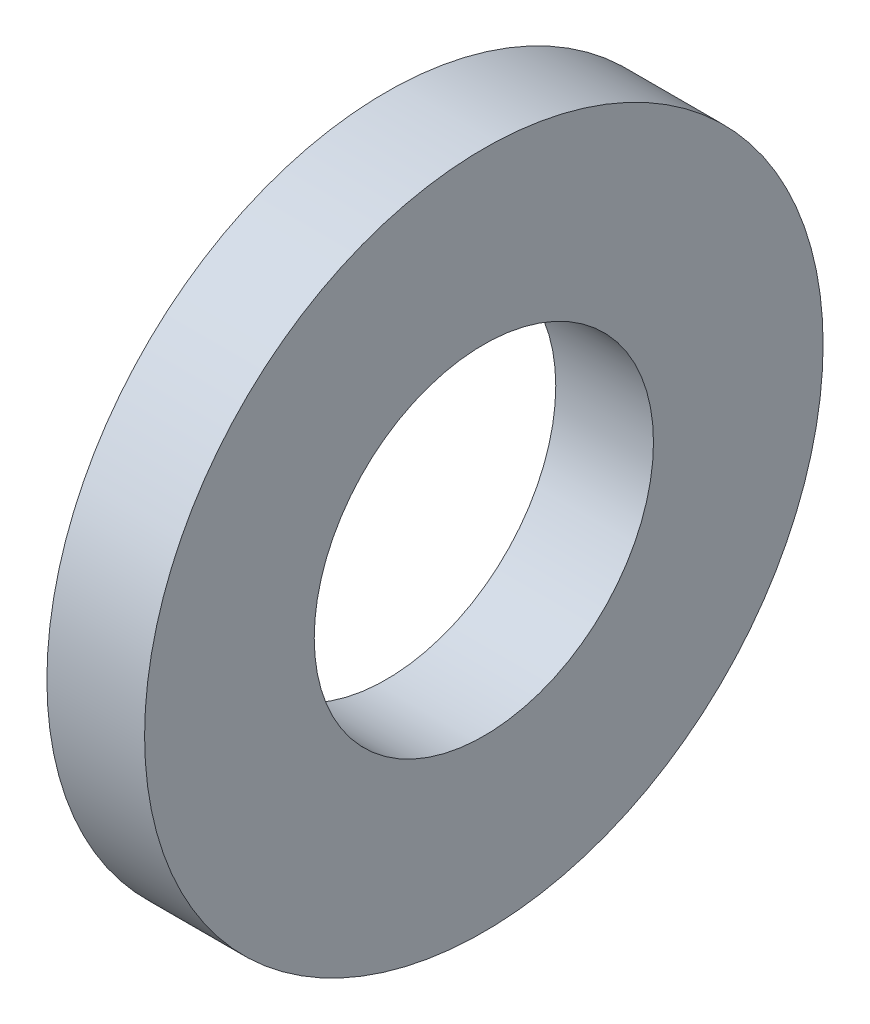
ISO-10303-21;
HEADER;
FILE_DESCRIPTION(('STEP AP214'),'2;1');
FILE_NAME('part.step','',(''),(''),'','','');
FILE_SCHEMA(('AUTOMOTIVE_DESIGN { 1 0 10303 214 1 1 1 1 }'));
ENDSEC;
DATA;
#1=APPLICATION_CONTEXT('core data for automotive mechanical design processes');
#2=APPLICATION_PROTOCOL_DEFINITION('international standard','automotive_design',2000,#1);
#3=PRODUCT_CONTEXT('',#1,'mechanical');
#4=PRODUCT('Part','Part','',(#3));
#5=PRODUCT_RELATED_PRODUCT_CATEGORY('part','',(#4));
#6=PRODUCT_DEFINITION_FORMATION('','',#4);
#7=PRODUCT_DEFINITION_CONTEXT('part definition',#1,'design');
#8=PRODUCT_DEFINITION('design','',#6,#7);
#9=PRODUCT_DEFINITION_SHAPE('','',#8);
#10=(LENGTH_UNIT() NAMED_UNIT(*) SI_UNIT(.MILLI.,.METRE.));
#11=(NAMED_UNIT(*) PLANE_ANGLE_UNIT() SI_UNIT($,.RADIAN.));
#12=(NAMED_UNIT(*) SI_UNIT($,.STERADIAN.) SOLID_ANGLE_UNIT());
#13=UNCERTAINTY_MEASURE_WITH_UNIT(LENGTH_MEASURE(1.E-05),#10,'distance_accuracy_value','');
#14=(GEOMETRIC_REPRESENTATION_CONTEXT(3) GLOBAL_UNCERTAINTY_ASSIGNED_CONTEXT((#13)) GLOBAL_UNIT_ASSIGNED_CONTEXT((#10,
#11,#12)) REPRESENTATION_CONTEXT('',''));
#15=CARTESIAN_POINT('',(0.,0.,0.));
#16=DIRECTION('',(0.,0.,1.));
#17=DIRECTION('',(1.,0.,0.));
#18=AXIS2_PLACEMENT_3D('',#15,#16,#17);
#19=CARTESIAN_POINT('',(0.9144,0.,0.));
#20=DIRECTION('',(1.,0.,0.));
#21=DIRECTION('',(0.,0.,-1.));
#22=AXIS2_PLACEMENT_3D('',#19,#20,#21);
#23=PLANE('',#22);
#24=CARTESIAN_POINT('',(0.9144,0.,0.));
#25=DIRECTION('',(1.,0.,0.));
#26=DIRECTION('',(0.,0.,-1.));
#27=AXIS2_PLACEMENT_3D('',#24,#25,#26);
#28=CIRCLE('',#27,3.175);
#29=CARTESIAN_POINT('',(0.9144,0.,-3.175));
#30=VERTEX_POINT('',#29);
#31=EDGE_CURVE('E10',#30,#30,#28,.T.);
#32=ORIENTED_EDGE('',*,*,#31,.T.);
#33=EDGE_LOOP('',(#32));
#34=FACE_BOUND('',#33,.T.);
#35=CARTESIAN_POINT('',(0.9144,0.,0.));
#36=DIRECTION('',(1.,0.,0.));
#37=DIRECTION('',(0.,0.,-1.));
#38=AXIS2_PLACEMENT_3D('',#35,#36,#37);
#39=CIRCLE('',#38,1.5875);
#40=CARTESIAN_POINT('',(0.9144,0.,-1.5875));
#41=VERTEX_POINT('',#40);
#42=EDGE_CURVE('E41',#41,#41,#39,.T.);
#43=ORIENTED_EDGE('',*,*,#42,.F.);
#44=EDGE_LOOP('',(#43));
#45=FACE_BOUND('',#44,.T.);
#46=ADVANCED_FACE('F30',(#34,#45),#23,.T.);
#47=CARTESIAN_POINT('',(0.,0.,0.));
#48=DIRECTION('',(1.,0.,0.));
#49=DIRECTION('',(0.,0.,-1.));
#50=AXIS2_PLACEMENT_3D('',#47,#48,#49);
#51=PLANE('',#50);
#52=CARTESIAN_POINT('',(0.,0.,0.));
#53=DIRECTION('',(1.,0.,0.));
#54=DIRECTION('',(0.,0.,-1.));
#55=AXIS2_PLACEMENT_3D('',#52,#53,#54);
#56=CIRCLE('',#55,3.175);
#57=CARTESIAN_POINT('',(0.,0.,-3.175));
#58=VERTEX_POINT('',#57);
#59=EDGE_CURVE('E34',#58,#58,#56,.T.);
#60=ORIENTED_EDGE('',*,*,#59,.F.);
#61=EDGE_LOOP('',(#60));
#62=FACE_BOUND('',#61,.T.);
#63=CARTESIAN_POINT('',(0.,0.,0.));
#64=DIRECTION('',(1.,0.,0.));
#65=DIRECTION('',(0.,0.,-1.));
#66=AXIS2_PLACEMENT_3D('',#63,#64,#65);
#67=CIRCLE('',#66,1.5875);
#68=CARTESIAN_POINT('',(0.,0.,-1.5875));
#69=VERTEX_POINT('',#68);
#70=EDGE_CURVE('E43',#69,#69,#67,.T.);
#71=ORIENTED_EDGE('',*,*,#70,.T.);
#72=EDGE_LOOP('',(#71));
#73=FACE_BOUND('',#72,.T.);
#74=ADVANCED_FACE('F53',(#62,#73),#51,.F.);
#75=CARTESIAN_POINT('',(0.9144,0.,0.));
#76=DIRECTION('',(-1.,0.,0.));
#77=DIRECTION('',(0.,0.,1.));
#78=AXIS2_PLACEMENT_3D('',#75,#76,#77);
#79=CYLINDRICAL_SURFACE('',#78,3.175);
#80=ORIENTED_EDGE('',*,*,#31,.F.);
#81=EDGE_LOOP('',(#80));
#82=FACE_BOUND('',#81,.T.);
#83=ORIENTED_EDGE('',*,*,#59,.T.);
#84=EDGE_LOOP('',(#83));
#85=FACE_BOUND('',#84,.T.);
#86=ADVANCED_FACE('F32',(#82,#85),#79,.T.);
#87=CARTESIAN_POINT('',(0.9144,0.,0.));
#88=DIRECTION('',(-1.,0.,0.));
#89=DIRECTION('',(0.,0.,1.));
#90=AXIS2_PLACEMENT_3D('',#87,#88,#89);
#91=CYLINDRICAL_SURFACE('',#90,1.5875);
#92=ORIENTED_EDGE('',*,*,#42,.T.);
#93=EDGE_LOOP('',(#92));
#94=FACE_BOUND('',#93,.T.);
#95=ORIENTED_EDGE('',*,*,#70,.F.);
#96=EDGE_LOOP('',(#95));
#97=FACE_BOUND('',#96,.T.);
#98=ADVANCED_FACE('F49',(#94,#97),#91,.F.);
#99=CLOSED_SHELL('',(#46,#74,#86,#98));
#100=MANIFOLD_SOLID_BREP('B2',#99);
#101=ADVANCED_BREP_SHAPE_REPRESENTATION('',(#18,#100),#14);
#102=SHAPE_DEFINITION_REPRESENTATION(#9,#101);
ENDSEC;
END-ISO-10303-21;
